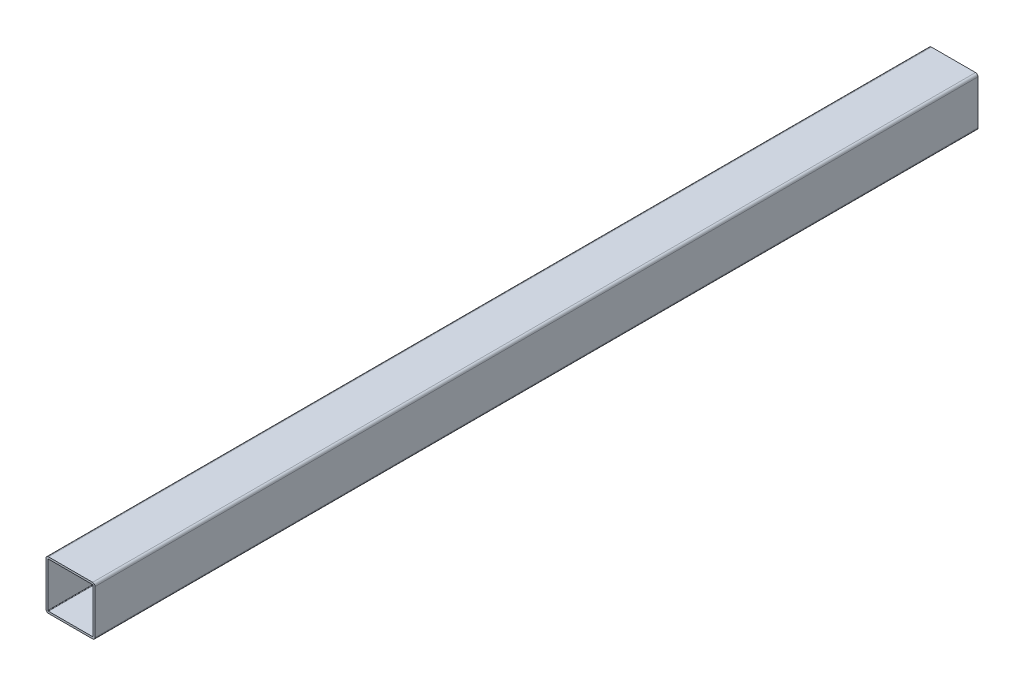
ISO-10303-21;
HEADER;
FILE_DESCRIPTION(('STEP AP214'),'2;1');
FILE_NAME('part.step','',(''),(''),'','','');
FILE_SCHEMA(('AUTOMOTIVE_DESIGN { 1 0 10303 214 1 1 1 1 }'));
ENDSEC;
DATA;
#1=APPLICATION_CONTEXT('core data for automotive mechanical design processes');
#2=APPLICATION_PROTOCOL_DEFINITION('international standard','automotive_design',2000,#1);
#3=PRODUCT_CONTEXT('',#1,'mechanical');
#4=PRODUCT('Part','Part','',(#3));
#5=PRODUCT_RELATED_PRODUCT_CATEGORY('part','',(#4));
#6=PRODUCT_DEFINITION_FORMATION('','',#4);
#7=PRODUCT_DEFINITION_CONTEXT('part definition',#1,'design');
#8=PRODUCT_DEFINITION('design','',#6,#7);
#9=PRODUCT_DEFINITION_SHAPE('','',#8);
#10=(LENGTH_UNIT() NAMED_UNIT(*) SI_UNIT(.MILLI.,.METRE.));
#11=(NAMED_UNIT(*) PLANE_ANGLE_UNIT() SI_UNIT($,.RADIAN.));
#12=(NAMED_UNIT(*) SI_UNIT($,.STERADIAN.) SOLID_ANGLE_UNIT());
#13=UNCERTAINTY_MEASURE_WITH_UNIT(LENGTH_MEASURE(1.E-05),#10,'distance_accuracy_value','');
#14=(GEOMETRIC_REPRESENTATION_CONTEXT(3) GLOBAL_UNCERTAINTY_ASSIGNED_CONTEXT((#13)) GLOBAL_UNIT_ASSIGNED_CONTEXT((#10,
#11,#12)) REPRESENTATION_CONTEXT('',''));
#15=CARTESIAN_POINT('',(0.,0.,0.));
#16=DIRECTION('',(0.,0.,1.));
#17=DIRECTION('',(1.,0.,0.));
#18=AXIS2_PLACEMENT_3D('',#15,#16,#17);
#19=CARTESIAN_POINT('',(95.,-5.,1800.));
#20=DIRECTION('',(0.,0.,1.));
#21=DIRECTION('',(1.,0.,0.));
#22=AXIS2_PLACEMENT_3D('',#19,#20,#21);
#23=PLANE('',#22);
#24=CARTESIAN_POINT('',(95.,-5.,1800.));
#25=DIRECTION('',(0.,0.,1.));
#26=DIRECTION('',(1.,0.,0.));
#27=AXIS2_PLACEMENT_3D('',#24,#25,#26);
#28=CIRCLE('',#27,5.);
#29=CARTESIAN_POINT('',(100.,-5.00000000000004,1800.));
#30=VERTEX_POINT('',#29);
#31=CARTESIAN_POINT('',(95.,0.,1800.));
#32=VERTEX_POINT('',#31);
#33=EDGE_CURVE('E223',#30,#32,#28,.T.);
#34=ORIENTED_EDGE('',*,*,#33,.T.);
#35=DIRECTION('',(-1.,0.,0.));
#36=VECTOR('',#35,1.);
#37=CARTESIAN_POINT('',(5.00000000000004,0.,1800.));
#38=LINE('',#37,#36);
#39=CARTESIAN_POINT('',(5.00000000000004,0.,1800.));
#40=VERTEX_POINT('',#39);
#41=EDGE_CURVE('E226',#32,#40,#38,.T.);
#42=ORIENTED_EDGE('',*,*,#41,.T.);
#43=CARTESIAN_POINT('',(5.,-5.,1800.));
#44=DIRECTION('',(0.,0.,1.));
#45=DIRECTION('',(1.,0.,0.));
#46=AXIS2_PLACEMENT_3D('',#43,#44,#45);
#47=CIRCLE('',#46,5.);
#48=CARTESIAN_POINT('',(0.,-5.00000000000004,1800.));
#49=VERTEX_POINT('',#48);
#50=EDGE_CURVE('E228',#40,#49,#47,.T.);
#51=ORIENTED_EDGE('',*,*,#50,.T.);
#52=DIRECTION('',(0.,-1.,0.));
#53=VECTOR('',#52,1.);
#54=CARTESIAN_POINT('',(0.,-5.00000000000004,1800.));
#55=LINE('',#54,#53);
#56=CARTESIAN_POINT('',(0.,-95.,1800.));
#57=VERTEX_POINT('',#56);
#58=EDGE_CURVE('E230',#49,#57,#55,.T.);
#59=ORIENTED_EDGE('',*,*,#58,.T.);
#60=CARTESIAN_POINT('',(5.00000000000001,-95.,1800.));
#61=DIRECTION('',(0.,0.,1.));
#62=DIRECTION('',(-1.,0.,0.));
#63=AXIS2_PLACEMENT_3D('',#60,#61,#62);
#64=CIRCLE('',#63,5.);
#65=CARTESIAN_POINT('',(5.00000000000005,-100.,1800.));
#66=VERTEX_POINT('',#65);
#67=EDGE_CURVE('E232',#57,#66,#64,.T.);
#68=ORIENTED_EDGE('',*,*,#67,.T.);
#69=DIRECTION('',(1.,0.,0.));
#70=VECTOR('',#69,1.);
#71=CARTESIAN_POINT('',(5.00000000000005,-100.,1800.));
#72=LINE('',#71,#70);
#73=CARTESIAN_POINT('',(95.,-100.,1800.));
#74=VERTEX_POINT('',#73);
#75=EDGE_CURVE('E234',#66,#74,#72,.T.);
#76=ORIENTED_EDGE('',*,*,#75,.T.);
#77=CARTESIAN_POINT('',(95.,-95.,1800.));
#78=DIRECTION('',(0.,0.,1.));
#79=DIRECTION('',(1.,0.,0.));
#80=AXIS2_PLACEMENT_3D('',#77,#78,#79);
#81=CIRCLE('',#80,5.);
#82=CARTESIAN_POINT('',(100.,-95.,1800.));
#83=VERTEX_POINT('',#82);
#84=EDGE_CURVE('E236',#74,#83,#81,.T.);
#85=ORIENTED_EDGE('',*,*,#84,.T.);
#86=DIRECTION('',(0.,1.,0.));
#87=VECTOR('',#86,1.);
#88=CARTESIAN_POINT('',(100.,-5.00000000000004,1800.));
#89=LINE('',#88,#87);
#90=EDGE_CURVE('E238',#83,#30,#89,.T.);
#91=ORIENTED_EDGE('',*,*,#90,.T.);
#92=EDGE_LOOP('',(#34,#42,#51,#59,#68,#76,#85,#91));
#93=FACE_BOUND('',#92,.T.);
#94=DIRECTION('',(0.,-1.,0.));
#95=VECTOR('',#94,1.);
#96=CARTESIAN_POINT('',(4.,-5.00000000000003,1800.));
#97=LINE('',#96,#95);
#98=CARTESIAN_POINT('',(4.,-5.00000000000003,1800.));
#99=VERTEX_POINT('',#98);
#100=CARTESIAN_POINT('',(4.00000000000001,-95.,1800.));
#101=VERTEX_POINT('',#100);
#102=EDGE_CURVE('E181',#99,#101,#97,.T.);
#103=ORIENTED_EDGE('',*,*,#102,.F.);
#104=CARTESIAN_POINT('',(5.,-5.,1800.));
#105=DIRECTION('',(0.,0.,1.));
#106=DIRECTION('',(1.,0.,0.));
#107=AXIS2_PLACEMENT_3D('',#104,#105,#106);
#108=CIRCLE('',#107,0.999999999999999);
#109=CARTESIAN_POINT('',(5.00000000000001,-4.,1800.));
#110=VERTEX_POINT('',#109);
#111=EDGE_CURVE('E158',#110,#99,#108,.T.);
#112=ORIENTED_EDGE('',*,*,#111,.F.);
#113=DIRECTION('',(-1.,0.,0.));
#114=VECTOR('',#113,1.);
#115=CARTESIAN_POINT('',(5.00000000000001,-4.,1800.));
#116=LINE('',#115,#114);
#117=CARTESIAN_POINT('',(95.,-4.,1800.));
#118=VERTEX_POINT('',#117);
#119=EDGE_CURVE('E193',#118,#110,#116,.T.);
#120=ORIENTED_EDGE('',*,*,#119,.F.);
#121=CARTESIAN_POINT('',(95.,-5.,1800.));
#122=DIRECTION('',(0.,0.,1.));
#123=DIRECTION('',(1.,0.,0.));
#124=AXIS2_PLACEMENT_3D('',#121,#122,#123);
#125=CIRCLE('',#124,1.);
#126=CARTESIAN_POINT('',(96.,-5.00000000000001,1800.));
#127=VERTEX_POINT('',#126);
#128=EDGE_CURVE('E191',#127,#118,#125,.T.);
#129=ORIENTED_EDGE('',*,*,#128,.F.);
#130=DIRECTION('',(0.,1.,0.));
#131=VECTOR('',#130,1.);
#132=CARTESIAN_POINT('',(96.,-5.00000000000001,1800.));
#133=LINE('',#132,#131);
#134=CARTESIAN_POINT('',(96.,-95.,1800.));
#135=VERTEX_POINT('',#134);
#136=EDGE_CURVE('E189',#135,#127,#133,.T.);
#137=ORIENTED_EDGE('',*,*,#136,.F.);
#138=CARTESIAN_POINT('',(95.,-95.,1800.));
#139=DIRECTION('',(0.,0.,1.));
#140=DIRECTION('',(1.,0.,0.));
#141=AXIS2_PLACEMENT_3D('',#138,#139,#140);
#142=CIRCLE('',#141,1.);
#143=CARTESIAN_POINT('',(95.,-96.,1800.));
#144=VERTEX_POINT('',#143);
#145=EDGE_CURVE('E187',#144,#135,#142,.T.);
#146=ORIENTED_EDGE('',*,*,#145,.F.);
#147=DIRECTION('',(1.,0.,0.));
#148=VECTOR('',#147,1.);
#149=CARTESIAN_POINT('',(5.00000000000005,-96.,1800.));
#150=LINE('',#149,#148);
#151=CARTESIAN_POINT('',(5.00000000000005,-96.,1800.));
#152=VERTEX_POINT('',#151);
#153=EDGE_CURVE('E185',#152,#144,#150,.T.);
#154=ORIENTED_EDGE('',*,*,#153,.F.);
#155=CARTESIAN_POINT('',(5.00000000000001,-95.,1800.));
#156=DIRECTION('',(0.,0.,1.));
#157=DIRECTION('',(-1.,0.,0.));
#158=AXIS2_PLACEMENT_3D('',#155,#156,#157);
#159=CIRCLE('',#158,1.);
#160=EDGE_CURVE('E183',#101,#152,#159,.T.);
#161=ORIENTED_EDGE('',*,*,#160,.F.);
#162=EDGE_LOOP('',(#103,#112,#120,#129,#137,#146,#154,#161));
#163=FACE_BOUND('',#162,.T.);
#164=ADVANCED_FACE('F30',(#93,#163),#23,.T.);
#165=CARTESIAN_POINT('',(95.,-5.,0.));
#166=DIRECTION('',(0.,0.,1.));
#167=DIRECTION('',(1.,0.,0.));
#168=AXIS2_PLACEMENT_3D('',#165,#166,#167);
#169=PLANE('',#168);
#170=CARTESIAN_POINT('',(95.,-5.,0.));
#171=DIRECTION('',(0.,0.,1.));
#172=DIRECTION('',(1.,0.,0.));
#173=AXIS2_PLACEMENT_3D('',#170,#171,#172);
#174=CIRCLE('',#173,5.);
#175=CARTESIAN_POINT('',(100.,-5.00000000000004,0.));
#176=VERTEX_POINT('',#175);
#177=CARTESIAN_POINT('',(95.,0.,0.));
#178=VERTEX_POINT('',#177);
#179=EDGE_CURVE('E159',#176,#178,#174,.T.);
#180=ORIENTED_EDGE('',*,*,#179,.F.);
#181=DIRECTION('',(0.,1.,0.));
#182=VECTOR('',#181,1.);
#183=CARTESIAN_POINT('',(100.,-5.00000000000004,0.));
#184=LINE('',#183,#182);
#185=CARTESIAN_POINT('',(100.,-95.,0.));
#186=VERTEX_POINT('',#185);
#187=EDGE_CURVE('E221',#186,#176,#184,.T.);
#188=ORIENTED_EDGE('',*,*,#187,.F.);
#189=CARTESIAN_POINT('',(95.,-95.,0.));
#190=DIRECTION('',(0.,0.,1.));
#191=DIRECTION('',(1.,0.,0.));
#192=AXIS2_PLACEMENT_3D('',#189,#190,#191);
#193=CIRCLE('',#192,5.);
#194=CARTESIAN_POINT('',(95.,-100.,0.));
#195=VERTEX_POINT('',#194);
#196=EDGE_CURVE('E219',#195,#186,#193,.T.);
#197=ORIENTED_EDGE('',*,*,#196,.F.);
#198=DIRECTION('',(1.,0.,0.));
#199=VECTOR('',#198,1.);
#200=CARTESIAN_POINT('',(5.00000000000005,-100.,0.));
#201=LINE('',#200,#199);
#202=CARTESIAN_POINT('',(5.00000000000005,-100.,0.));
#203=VERTEX_POINT('',#202);
#204=EDGE_CURVE('E217',#203,#195,#201,.T.);
#205=ORIENTED_EDGE('',*,*,#204,.F.);
#206=CARTESIAN_POINT('',(5.00000000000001,-95.,0.));
#207=DIRECTION('',(0.,0.,1.));
#208=DIRECTION('',(-1.,0.,0.));
#209=AXIS2_PLACEMENT_3D('',#206,#207,#208);
#210=CIRCLE('',#209,5.);
#211=CARTESIAN_POINT('',(0.,-95.,0.));
#212=VERTEX_POINT('',#211);
#213=EDGE_CURVE('E215',#212,#203,#210,.T.);
#214=ORIENTED_EDGE('',*,*,#213,.F.);
#215=DIRECTION('',(0.,-1.,0.));
#216=VECTOR('',#215,1.);
#217=CARTESIAN_POINT('',(0.,-5.00000000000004,0.));
#218=LINE('',#217,#216);
#219=CARTESIAN_POINT('',(0.,-5.00000000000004,0.));
#220=VERTEX_POINT('',#219);
#221=EDGE_CURVE('E213',#220,#212,#218,.T.);
#222=ORIENTED_EDGE('',*,*,#221,.F.);
#223=CARTESIAN_POINT('',(5.,-5.,0.));
#224=DIRECTION('',(0.,0.,1.));
#225=DIRECTION('',(1.,0.,0.));
#226=AXIS2_PLACEMENT_3D('',#223,#224,#225);
#227=CIRCLE('',#226,5.);
#228=CARTESIAN_POINT('',(5.00000000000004,0.,0.));
#229=VERTEX_POINT('',#228);
#230=EDGE_CURVE('E211',#229,#220,#227,.T.);
#231=ORIENTED_EDGE('',*,*,#230,.F.);
#232=DIRECTION('',(-1.,0.,0.));
#233=VECTOR('',#232,1.);
#234=CARTESIAN_POINT('',(5.00000000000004,0.,0.));
#235=LINE('',#234,#233);
#236=EDGE_CURVE('E209',#178,#229,#235,.T.);
#237=ORIENTED_EDGE('',*,*,#236,.F.);
#238=EDGE_LOOP('',(#180,#188,#197,#205,#214,#222,#231,#237));
#239=FACE_BOUND('',#238,.T.);
#240=CARTESIAN_POINT('',(5.,-5.,0.));
#241=DIRECTION('',(0.,0.,1.));
#242=DIRECTION('',(1.,0.,0.));
#243=AXIS2_PLACEMENT_3D('',#240,#241,#242);
#244=CIRCLE('',#243,0.999999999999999);
#245=CARTESIAN_POINT('',(5.,-4.,0.));
#246=VERTEX_POINT('',#245);
#247=CARTESIAN_POINT('',(4.,-5.00000000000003,0.));
#248=VERTEX_POINT('',#247);
#249=EDGE_CURVE('E53',#246,#248,#244,.T.);
#250=ORIENTED_EDGE('',*,*,#249,.T.);
#251=DIRECTION('',(0.,-1.,0.));
#252=VECTOR('',#251,1.);
#253=CARTESIAN_POINT('',(4.,-5.00000000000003,0.));
#254=LINE('',#253,#252);
#255=CARTESIAN_POINT('',(4.00000000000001,-95.,0.));
#256=VERTEX_POINT('',#255);
#257=EDGE_CURVE('E145',#248,#256,#254,.T.);
#258=ORIENTED_EDGE('',*,*,#257,.T.);
#259=CARTESIAN_POINT('',(5.00000000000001,-95.,0.));
#260=DIRECTION('',(0.,0.,1.));
#261=DIRECTION('',(-1.,0.,0.));
#262=AXIS2_PLACEMENT_3D('',#259,#260,#261);
#263=CIRCLE('',#262,1.);
#264=CARTESIAN_POINT('',(5.00000000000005,-96.,0.));
#265=VERTEX_POINT('',#264);
#266=EDGE_CURVE('E154',#256,#265,#263,.T.);
#267=ORIENTED_EDGE('',*,*,#266,.T.);
#268=DIRECTION('',(1.,0.,0.));
#269=VECTOR('',#268,1.);
#270=CARTESIAN_POINT('',(5.00000000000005,-96.,0.));
#271=LINE('',#270,#269);
#272=CARTESIAN_POINT('',(95.,-96.,0.));
#273=VERTEX_POINT('',#272);
#274=EDGE_CURVE('E168',#265,#273,#271,.T.);
#275=ORIENTED_EDGE('',*,*,#274,.T.);
#276=CARTESIAN_POINT('',(95.,-95.,0.));
#277=DIRECTION('',(0.,0.,1.));
#278=DIRECTION('',(1.,0.,0.));
#279=AXIS2_PLACEMENT_3D('',#276,#277,#278);
#280=CIRCLE('',#279,1.);
#281=CARTESIAN_POINT('',(96.,-95.,0.));
#282=VERTEX_POINT('',#281);
#283=EDGE_CURVE('E171',#273,#282,#280,.T.);
#284=ORIENTED_EDGE('',*,*,#283,.T.);
#285=DIRECTION('',(0.,1.,0.));
#286=VECTOR('',#285,1.);
#287=CARTESIAN_POINT('',(96.,-5.00000000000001,0.));
#288=LINE('',#287,#286);
#289=CARTESIAN_POINT('',(96.,-5.00000000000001,0.));
#290=VERTEX_POINT('',#289);
#291=EDGE_CURVE('E174',#282,#290,#288,.T.);
#292=ORIENTED_EDGE('',*,*,#291,.T.);
#293=CARTESIAN_POINT('',(95.,-5.,0.));
#294=DIRECTION('',(0.,0.,1.));
#295=DIRECTION('',(1.,0.,0.));
#296=AXIS2_PLACEMENT_3D('',#293,#294,#295);
#297=CIRCLE('',#296,1.);
#298=CARTESIAN_POINT('',(95.,-4.,0.));
#299=VERTEX_POINT('',#298);
#300=EDGE_CURVE('E177',#290,#299,#297,.T.);
#301=ORIENTED_EDGE('',*,*,#300,.T.);
#302=DIRECTION('',(-1.,0.,0.));
#303=VECTOR('',#302,1.);
#304=CARTESIAN_POINT('',(5.00000000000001,-4.,0.));
#305=LINE('',#304,#303);
#306=EDGE_CURVE('E164',#299,#246,#305,.T.);
#307=ORIENTED_EDGE('',*,*,#306,.T.);
#308=EDGE_LOOP('',(#250,#258,#267,#275,#284,#292,#301,#307));
#309=FACE_BOUND('',#308,.T.);
#310=ADVANCED_FACE('F162',(#239,#309),#169,.F.);
#311=CARTESIAN_POINT('',(95.,-5.,1800.));
#312=DIRECTION('',(0.,0.,-1.));
#313=DIRECTION('',(-1.,0.,0.));
#314=AXIS2_PLACEMENT_3D('',#311,#312,#313);
#315=CYLINDRICAL_SURFACE('',#314,5.);
#316=ORIENTED_EDGE('',*,*,#179,.T.);
#317=DIRECTION('',(0.,0.,-1.));
#318=VECTOR('',#317,1.);
#319=CARTESIAN_POINT('',(95.,0.,1800.));
#320=LINE('',#319,#318);
#321=EDGE_CURVE('E11',#32,#178,#320,.T.);
#322=ORIENTED_EDGE('',*,*,#321,.F.);
#323=ORIENTED_EDGE('',*,*,#33,.F.);
#324=DIRECTION('',(0.,0.,-1.));
#325=VECTOR('',#324,1.);
#326=CARTESIAN_POINT('',(100.,-5.00000000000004,1800.));
#327=LINE('',#326,#325);
#328=EDGE_CURVE('E240',#30,#176,#327,.T.);
#329=ORIENTED_EDGE('',*,*,#328,.T.);
#330=EDGE_LOOP('',(#316,#322,#323,#329));
#331=FACE_BOUND('',#330,.T.);
#332=ADVANCED_FACE('F32',(#331),#315,.T.);
#333=CARTESIAN_POINT('',(5.00000000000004,0.,1800.));
#334=DIRECTION('',(0.,-1.,0.));
#335=DIRECTION('',(0.,0.,-1.));
#336=AXIS2_PLACEMENT_3D('',#333,#334,#335);
#337=PLANE('',#336);
#338=ORIENTED_EDGE('',*,*,#236,.T.);
#339=DIRECTION('',(0.,0.,-1.));
#340=VECTOR('',#339,1.);
#341=CARTESIAN_POINT('',(5.00000000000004,0.,1800.));
#342=LINE('',#341,#340);
#343=EDGE_CURVE('E38',#40,#229,#342,.T.);
#344=ORIENTED_EDGE('',*,*,#343,.F.);
#345=ORIENTED_EDGE('',*,*,#41,.F.);
#346=ORIENTED_EDGE('',*,*,#321,.T.);
#347=EDGE_LOOP('',(#338,#344,#345,#346));
#348=FACE_BOUND('',#347,.T.);
#349=ADVANCED_FACE('F286',(#348),#337,.F.);
#350=CARTESIAN_POINT('',(5.,-5.,1800.));
#351=DIRECTION('',(0.,0.,-1.));
#352=DIRECTION('',(-1.,0.,0.));
#353=AXIS2_PLACEMENT_3D('',#350,#351,#352);
#354=CYLINDRICAL_SURFACE('',#353,5.);
#355=ORIENTED_EDGE('',*,*,#230,.T.);
#356=DIRECTION('',(0.,0.,-1.));
#357=VECTOR('',#356,1.);
#358=CARTESIAN_POINT('',(0.,-5.00000000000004,1800.));
#359=LINE('',#358,#357);
#360=EDGE_CURVE('E257',#49,#220,#359,.T.);
#361=ORIENTED_EDGE('',*,*,#360,.F.);
#362=ORIENTED_EDGE('',*,*,#50,.F.);
#363=ORIENTED_EDGE('',*,*,#343,.T.);
#364=EDGE_LOOP('',(#355,#361,#362,#363));
#365=FACE_BOUND('',#364,.T.);
#366=ADVANCED_FACE('F264',(#365),#354,.T.);
#367=CARTESIAN_POINT('',(0.,-5.00000000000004,1800.));
#368=DIRECTION('',(1.,0.,0.));
#369=DIRECTION('',(0.,1.,0.));
#370=AXIS2_PLACEMENT_3D('',#367,#368,#369);
#371=PLANE('',#370);
#372=ORIENTED_EDGE('',*,*,#221,.T.);
#373=DIRECTION('',(0.,0.,-1.));
#374=VECTOR('',#373,1.);
#375=CARTESIAN_POINT('',(0.,-95.,1800.));
#376=LINE('',#375,#374);
#377=EDGE_CURVE('E254',#57,#212,#376,.T.);
#378=ORIENTED_EDGE('',*,*,#377,.F.);
#379=ORIENTED_EDGE('',*,*,#58,.F.);
#380=ORIENTED_EDGE('',*,*,#360,.T.);
#381=EDGE_LOOP('',(#372,#378,#379,#380));
#382=FACE_BOUND('',#381,.T.);
#383=ADVANCED_FACE('F274',(#382),#371,.F.);
#384=CARTESIAN_POINT('',(5.00000000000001,-95.,1800.));
#385=DIRECTION('',(0.,0.,-1.));
#386=DIRECTION('',(-1.,0.,0.));
#387=AXIS2_PLACEMENT_3D('',#384,#385,#386);
#388=CYLINDRICAL_SURFACE('',#387,5.);
#389=ORIENTED_EDGE('',*,*,#213,.T.);
#390=DIRECTION('',(0.,0.,-1.));
#391=VECTOR('',#390,1.);
#392=CARTESIAN_POINT('',(5.00000000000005,-100.,1800.));
#393=LINE('',#392,#391);
#394=EDGE_CURVE('E250',#66,#203,#393,.T.);
#395=ORIENTED_EDGE('',*,*,#394,.F.);
#396=ORIENTED_EDGE('',*,*,#67,.F.);
#397=ORIENTED_EDGE('',*,*,#377,.T.);
#398=EDGE_LOOP('',(#389,#395,#396,#397));
#399=FACE_BOUND('',#398,.T.);
#400=ADVANCED_FACE('F278',(#399),#388,.T.);
#401=CARTESIAN_POINT('',(5.00000000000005,-100.,1800.));
#402=DIRECTION('',(0.,1.,0.));
#403=DIRECTION('',(0.,0.,1.));
#404=AXIS2_PLACEMENT_3D('',#401,#402,#403);
#405=PLANE('',#404);
#406=ORIENTED_EDGE('',*,*,#204,.T.);
#407=DIRECTION('',(0.,0.,-1.));
#408=VECTOR('',#407,1.);
#409=CARTESIAN_POINT('',(95.,-100.,1800.));
#410=LINE('',#409,#408);
#411=EDGE_CURVE('E246',#74,#195,#410,.T.);
#412=ORIENTED_EDGE('',*,*,#411,.F.);
#413=ORIENTED_EDGE('',*,*,#75,.F.);
#414=ORIENTED_EDGE('',*,*,#394,.T.);
#415=EDGE_LOOP('',(#406,#412,#413,#414));
#416=FACE_BOUND('',#415,.T.);
#417=ADVANCED_FACE('F299',(#416),#405,.F.);
#418=CARTESIAN_POINT('',(95.,-95.,1800.));
#419=DIRECTION('',(0.,0.,-1.));
#420=DIRECTION('',(-1.,0.,0.));
#421=AXIS2_PLACEMENT_3D('',#418,#419,#420);
#422=CYLINDRICAL_SURFACE('',#421,5.);
#423=ORIENTED_EDGE('',*,*,#196,.T.);
#424=DIRECTION('',(0.,0.,-1.));
#425=VECTOR('',#424,1.);
#426=CARTESIAN_POINT('',(100.,-95.,1800.));
#427=LINE('',#426,#425);
#428=EDGE_CURVE('E243',#83,#186,#427,.T.);
#429=ORIENTED_EDGE('',*,*,#428,.F.);
#430=ORIENTED_EDGE('',*,*,#84,.F.);
#431=ORIENTED_EDGE('',*,*,#411,.T.);
#432=EDGE_LOOP('',(#423,#429,#430,#431));
#433=FACE_BOUND('',#432,.T.);
#434=ADVANCED_FACE('F297',(#433),#422,.T.);
#435=CARTESIAN_POINT('',(100.,-5.00000000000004,1800.));
#436=DIRECTION('',(-1.,0.,0.));
#437=DIRECTION('',(0.,0.,1.));
#438=AXIS2_PLACEMENT_3D('',#435,#436,#437);
#439=PLANE('',#438);
#440=ORIENTED_EDGE('',*,*,#187,.T.);
#441=ORIENTED_EDGE('',*,*,#328,.F.);
#442=ORIENTED_EDGE('',*,*,#90,.F.);
#443=ORIENTED_EDGE('',*,*,#428,.T.);
#444=EDGE_LOOP('',(#440,#441,#442,#443));
#445=FACE_BOUND('',#444,.T.);
#446=ADVANCED_FACE('F292',(#445),#439,.F.);
#447=CARTESIAN_POINT('',(5.,-5.,1800.));
#448=DIRECTION('',(0.,0.,-1.));
#449=DIRECTION('',(-1.,0.,0.));
#450=AXIS2_PLACEMENT_3D('',#447,#448,#449);
#451=CYLINDRICAL_SURFACE('',#450,0.999999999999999);
#452=ORIENTED_EDGE('',*,*,#249,.F.);
#453=DIRECTION('',(0.,0.,-1.));
#454=VECTOR('',#453,1.);
#455=CARTESIAN_POINT('',(5.00000000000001,-4.,1800.));
#456=LINE('',#455,#454);
#457=EDGE_CURVE('E195',#110,#246,#456,.T.);
#458=ORIENTED_EDGE('',*,*,#457,.F.);
#459=ORIENTED_EDGE('',*,*,#111,.T.);
#460=DIRECTION('',(0.,0.,-1.));
#461=VECTOR('',#460,1.);
#462=CARTESIAN_POINT('',(4.,-5.00000000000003,1800.));
#463=LINE('',#462,#461);
#464=EDGE_CURVE('E147',#99,#248,#463,.T.);
#465=ORIENTED_EDGE('',*,*,#464,.T.);
#466=EDGE_LOOP('',(#452,#458,#459,#465));
#467=FACE_BOUND('',#466,.T.);
#468=ADVANCED_FACE('F156',(#467),#451,.F.);
#469=CARTESIAN_POINT('',(4.,-5.00000000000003,1800.));
#470=DIRECTION('',(1.,0.,0.));
#471=DIRECTION('',(0.,1.,0.));
#472=AXIS2_PLACEMENT_3D('',#469,#470,#471);
#473=PLANE('',#472);
#474=ORIENTED_EDGE('',*,*,#257,.F.);
#475=ORIENTED_EDGE('',*,*,#464,.F.);
#476=ORIENTED_EDGE('',*,*,#102,.T.);
#477=DIRECTION('',(0.,0.,-1.));
#478=VECTOR('',#477,1.);
#479=CARTESIAN_POINT('',(4.00000000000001,-95.,1800.));
#480=LINE('',#479,#478);
#481=EDGE_CURVE('E150',#101,#256,#480,.T.);
#482=ORIENTED_EDGE('',*,*,#481,.T.);
#483=EDGE_LOOP('',(#474,#475,#476,#482));
#484=FACE_BOUND('',#483,.T.);
#485=ADVANCED_FACE('F146',(#484),#473,.T.);
#486=CARTESIAN_POINT('',(5.00000000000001,-95.,1800.));
#487=DIRECTION('',(0.,0.,-1.));
#488=DIRECTION('',(-1.,0.,0.));
#489=AXIS2_PLACEMENT_3D('',#486,#487,#488);
#490=CYLINDRICAL_SURFACE('',#489,1.);
#491=ORIENTED_EDGE('',*,*,#266,.F.);
#492=ORIENTED_EDGE('',*,*,#481,.F.);
#493=ORIENTED_EDGE('',*,*,#160,.T.);
#494=DIRECTION('',(0.,0.,-1.));
#495=VECTOR('',#494,1.);
#496=CARTESIAN_POINT('',(5.00000000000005,-96.,1800.));
#497=LINE('',#496,#495);
#498=EDGE_CURVE('E204',#152,#265,#497,.T.);
#499=ORIENTED_EDGE('',*,*,#498,.T.);
#500=EDGE_LOOP('',(#491,#492,#493,#499));
#501=FACE_BOUND('',#500,.T.);
#502=ADVANCED_FACE('F323',(#501),#490,.F.);
#503=CARTESIAN_POINT('',(5.00000000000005,-96.,1800.));
#504=DIRECTION('',(0.,1.,0.));
#505=DIRECTION('',(0.,0.,1.));
#506=AXIS2_PLACEMENT_3D('',#503,#504,#505);
#507=PLANE('',#506);
#508=ORIENTED_EDGE('',*,*,#274,.F.);
#509=ORIENTED_EDGE('',*,*,#498,.F.);
#510=ORIENTED_EDGE('',*,*,#153,.T.);
#511=DIRECTION('',(0.,0.,-1.));
#512=VECTOR('',#511,1.);
#513=CARTESIAN_POINT('',(95.,-96.,1800.));
#514=LINE('',#513,#512);
#515=EDGE_CURVE('E202',#144,#273,#514,.T.);
#516=ORIENTED_EDGE('',*,*,#515,.T.);
#517=EDGE_LOOP('',(#508,#509,#510,#516));
#518=FACE_BOUND('',#517,.T.);
#519=ADVANCED_FACE('F328',(#518),#507,.T.);
#520=CARTESIAN_POINT('',(95.,-95.,1800.));
#521=DIRECTION('',(0.,0.,-1.));
#522=DIRECTION('',(-1.,0.,0.));
#523=AXIS2_PLACEMENT_3D('',#520,#521,#522);
#524=CYLINDRICAL_SURFACE('',#523,1.);
#525=ORIENTED_EDGE('',*,*,#283,.F.);
#526=ORIENTED_EDGE('',*,*,#515,.F.);
#527=ORIENTED_EDGE('',*,*,#145,.T.);
#528=DIRECTION('',(0.,0.,-1.));
#529=VECTOR('',#528,1.);
#530=CARTESIAN_POINT('',(96.,-95.,1800.));
#531=LINE('',#530,#529);
#532=EDGE_CURVE('E200',#135,#282,#531,.T.);
#533=ORIENTED_EDGE('',*,*,#532,.T.);
#534=EDGE_LOOP('',(#525,#526,#527,#533));
#535=FACE_BOUND('',#534,.T.);
#536=ADVANCED_FACE('F332',(#535),#524,.F.);
#537=CARTESIAN_POINT('',(96.,-5.00000000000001,1800.));
#538=DIRECTION('',(-1.,0.,0.));
#539=DIRECTION('',(0.,0.,1.));
#540=AXIS2_PLACEMENT_3D('',#537,#538,#539);
#541=PLANE('',#540);
#542=ORIENTED_EDGE('',*,*,#291,.F.);
#543=ORIENTED_EDGE('',*,*,#532,.F.);
#544=ORIENTED_EDGE('',*,*,#136,.T.);
#545=DIRECTION('',(0.,0.,-1.));
#546=VECTOR('',#545,1.);
#547=CARTESIAN_POINT('',(96.,-5.00000000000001,1800.));
#548=LINE('',#547,#546);
#549=EDGE_CURVE('E198',#127,#290,#548,.T.);
#550=ORIENTED_EDGE('',*,*,#549,.T.);
#551=EDGE_LOOP('',(#542,#543,#544,#550));
#552=FACE_BOUND('',#551,.T.);
#553=ADVANCED_FACE('F336',(#552),#541,.T.);
#554=CARTESIAN_POINT('',(95.,-5.,1800.));
#555=DIRECTION('',(0.,0.,-1.));
#556=DIRECTION('',(-1.,0.,0.));
#557=AXIS2_PLACEMENT_3D('',#554,#555,#556);
#558=CYLINDRICAL_SURFACE('',#557,1.);
#559=ORIENTED_EDGE('',*,*,#300,.F.);
#560=ORIENTED_EDGE('',*,*,#549,.F.);
#561=ORIENTED_EDGE('',*,*,#128,.T.);
#562=DIRECTION('',(0.,0.,-1.));
#563=VECTOR('',#562,1.);
#564=CARTESIAN_POINT('',(95.,-4.,1800.));
#565=LINE('',#564,#563);
#566=EDGE_CURVE('E45',#118,#299,#565,.T.);
#567=ORIENTED_EDGE('',*,*,#566,.T.);
#568=EDGE_LOOP('',(#559,#560,#561,#567));
#569=FACE_BOUND('',#568,.T.);
#570=ADVANCED_FACE('F340',(#569),#558,.F.);
#571=CARTESIAN_POINT('',(5.00000000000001,-4.,1800.));
#572=DIRECTION('',(0.,-1.,0.));
#573=DIRECTION('',(0.,0.,-1.));
#574=AXIS2_PLACEMENT_3D('',#571,#572,#573);
#575=PLANE('',#574);
#576=ORIENTED_EDGE('',*,*,#306,.F.);
#577=ORIENTED_EDGE('',*,*,#566,.F.);
#578=ORIENTED_EDGE('',*,*,#119,.T.);
#579=ORIENTED_EDGE('',*,*,#457,.T.);
#580=EDGE_LOOP('',(#576,#577,#578,#579));
#581=FACE_BOUND('',#580,.T.);
#582=ADVANCED_FACE('F344',(#581),#575,.T.);
#583=CLOSED_SHELL('',(#164,#310,#332,#349,#366,#383,#400,#417,#434,#446,#468,#485,#502,#519,
#536,#553,#570,#582));
#584=MANIFOLD_SOLID_BREP('B2',#583);
#585=ADVANCED_BREP_SHAPE_REPRESENTATION('',(#18,#584),#14);
#586=SHAPE_DEFINITION_REPRESENTATION(#9,#585);
ENDSEC;
END-ISO-10303-21;
